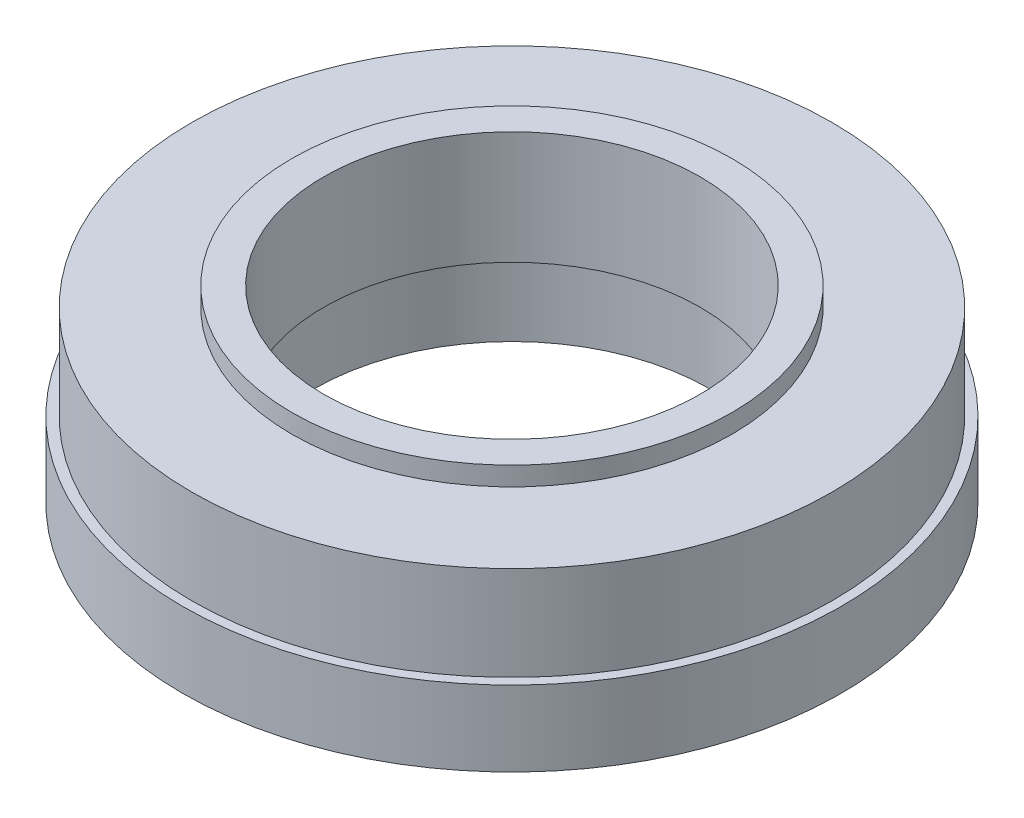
from build123d import *

# Parameters (mm, degrees)
SKETCH1_R      = 17.5
SKETCH1_R_2    = 10.5
EXTRUDE1_DEPTH = 4
SKETCH3_R      = 17
SKETCH3_R_2    = 10
EXTRUDE2_DEPTH = 2
SKETCH4_R      = 17
SKETCH4_R_2    = 10
EXTRUDE3_DEPTH = 3
SKETCH5_R      = 11.684
SKETCH5_R_2    = 10
EXTRUDE4_DEPTH = 1


with BuildPart() as part:
    # Sketch1 → Extrude1 (new body)
    with BuildSketch(Plane(origin=(0, 0, 0), x_dir=(1, 0, 0), z_dir=(0, 1, 0))):
        with Locations(Location((0, 0, 0), (0, 0, 270))):
            Circle(SKETCH1_R)
        with Locations(Location((0, 0, 0), (0, 0, 270))):
            Circle(SKETCH1_R_2, mode=Mode.SUBTRACT)
    extrude(amount=EXTRUDE1_DEPTH)

    # Sketch3 → Extrude2 (add)
    with BuildSketch(Plane(origin=(0, 4, 0), x_dir=(-1, 0, 0), z_dir=(0, 1, 0))):
        with Locations(Location((0, 0, 0), (0, 0, 90))):
            Circle(SKETCH3_R)
        with Locations(Location((0, 0, 0), (0, 0, 90))):
            Circle(SKETCH3_R_2, mode=Mode.SUBTRACT)
    extrude(amount=EXTRUDE2_DEPTH)

    # Sketch4 → Extrude3 (add)
    with BuildSketch(Plane(origin=(0, 6, 0), x_dir=(-1, 0, 0), z_dir=(0, 1, 0))):
        with Locations(Location((0, 0, 0), (0, 0, 90))):
            Circle(SKETCH4_R)
        with Locations(Location((0, 0, 0), (0, 0, 90))):
            Circle(SKETCH4_R_2, mode=Mode.SUBTRACT)
    extrude(amount=EXTRUDE3_DEPTH)

    # Sketch5 → Extrude4 (add)
    with BuildSketch(Plane(origin=(0, 9, 0), x_dir=(-1, 0, 0), z_dir=(0, 1, 0))):
        with Locations(Location((0, 0, 0), (0, 0, 90))):
            Circle(SKETCH5_R)
        with Locations(Location((0, 0, 0), (0, 0, 90))):
            Circle(SKETCH5_R_2, mode=Mode.SUBTRACT)
    extrude(amount=EXTRUDE4_DEPTH)


solid = part.part
